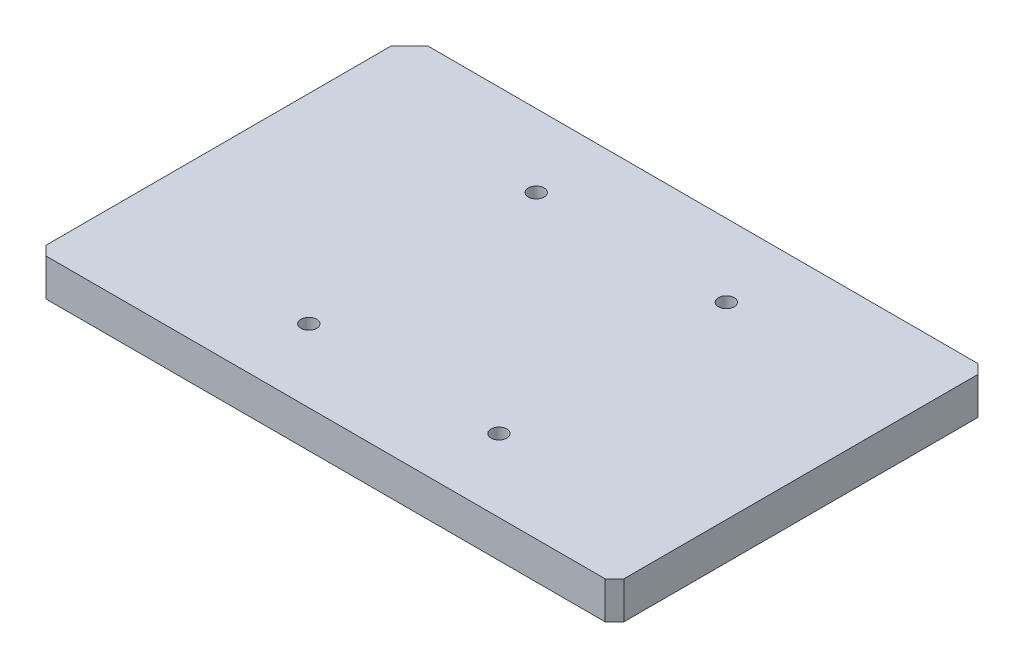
from build123d import *

# Parameters (mm, degrees)
BOSS_EXTRUDE1_DEPTH = 20
CUT_EXTRUDE1_REACH  = 187.54
SKETCH2_R           = 4.25
SKETCH3_R           = 7.5
CUT_EXTRUDE2_DEPTH  = 10


with BuildPart() as part:
    # Sketch1 → Boss-Extrude1 (new body)
    with BuildSketch(Plane(origin=(0, 0, 0), x_dir=(1, 0, 0), z_dir=(0, 1, 0))):
        Polygon((-155, -95), (-150, -100), (150, -100), (155, -95), (155, 95), (150, 100), (-145, 100), (-155, 90), align=None)
    extrude(amount=BOSS_EXTRUDE1_DEPTH)

    # Sketch2 → Cut-Extrude1 (cut, up to next)
    with BuildSketch(Plane.XZ, mode=Mode.PRIVATE) as cut_extrude1_sk1:
        with Locations(Location((-48, 61, 0), (0, 0, 270))):
            Circle(SKETCH2_R)
    cut_extrude1_tool1 = extrude(cut_extrude1_sk1.sketch, amount=-CUT_EXTRUDE1_REACH, mode=Mode.PRIVATE) & part.part
    # Sketch2 → Cut-Extrude1 (cut, up to next)
    with BuildSketch(Plane.XZ, mode=Mode.PRIVATE) as cut_extrude1_sk2:
        with Locations(Location((-48, -61, 0), (0, 0, 270))):
            Circle(SKETCH2_R)
    cut_extrude1_tool2 = extrude(cut_extrude1_sk2.sketch, amount=-CUT_EXTRUDE1_REACH, mode=Mode.PRIVATE) & part.part
    # Sketch2 → Cut-Extrude1 (cut, up to next)
    with BuildSketch(Plane.XZ, mode=Mode.PRIVATE) as cut_extrude1_sk3:
        with Locations(Location((54, -61, 0), (0, 0, 270))):
            Circle(SKETCH2_R)
    cut_extrude1_tool3 = extrude(cut_extrude1_sk3.sketch, amount=-CUT_EXTRUDE1_REACH, mode=Mode.PRIVATE) & part.part
    # Sketch2 → Cut-Extrude1 (cut, up to next)
    with BuildSketch(Plane.XZ, mode=Mode.PRIVATE) as cut_extrude1_sk4:
        with Locations(Location((54, 61, 0), (0, 0, 270))):
            Circle(SKETCH2_R)
    cut_extrude1_tool4 = extrude(cut_extrude1_sk4.sketch, amount=-CUT_EXTRUDE1_REACH, mode=Mode.PRIVATE) & part.part
    add(cut_extrude1_tool1.solids().sort_by_distance((-48, 0, 61))[0], mode=Mode.SUBTRACT)
    add(cut_extrude1_tool2.solids().sort_by_distance((-48, 0, -61))[0], mode=Mode.SUBTRACT)
    add(cut_extrude1_tool3.solids().sort_by_distance((54, 0, -61))[0], mode=Mode.SUBTRACT)
    add(cut_extrude1_tool4.solids().sort_by_distance((54, 0, 61))[0], mode=Mode.SUBTRACT)

    # Sketch3 → Cut-Extrude2 (cut)
    with BuildSketch(Plane.XZ):
        with Locations(Location((-48, 61, 0), (0, 0, 270))):
            Circle(SKETCH3_R)
        with Locations(Location((54, 61, 0), (0, 0, 270))):
            Circle(SKETCH3_R)
        with Locations(Location((54, -61, 0), (0, 0, 270))):
            Circle(SKETCH3_R)
        with Locations(Location((-48, -61, 0), (0, 0, 270))):
            Circle(SKETCH3_R)
    extrude(amount=-CUT_EXTRUDE2_DEPTH, mode=Mode.SUBTRACT)


solid = part.part
